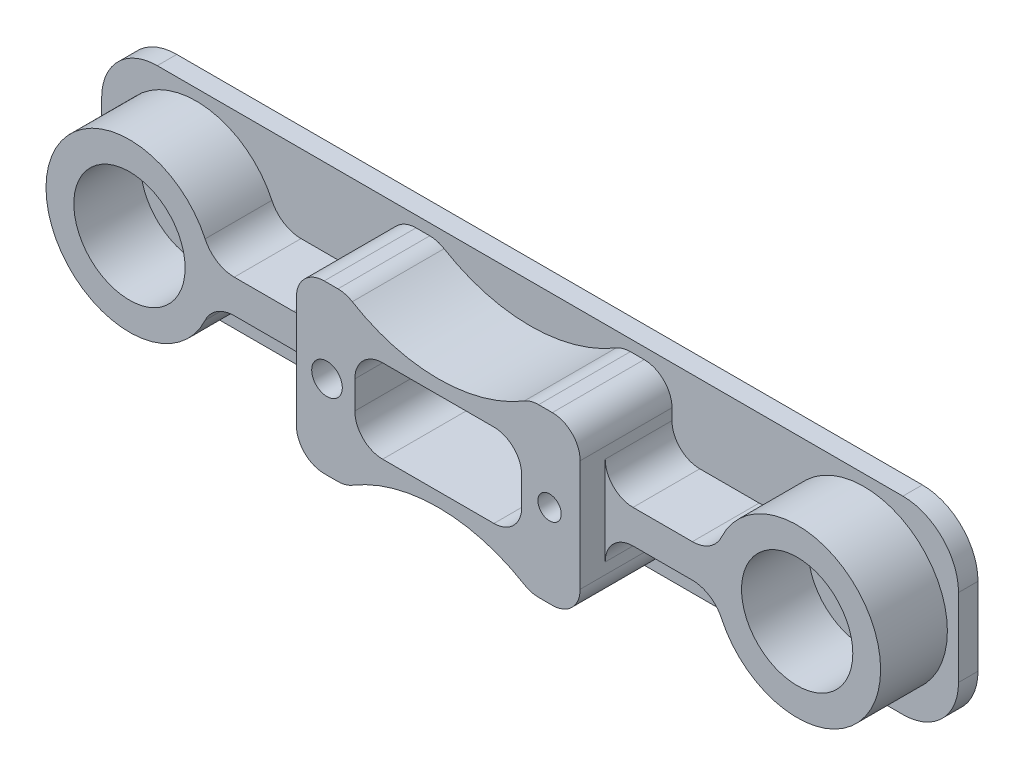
from build123d import *

# Parameters (mm, degrees)
AUFSATZ_LINEAR_AUSTRAGEN1_DEPTH                      = 3.5
AUFSATZ_LINEAR_AUSTRAGEN2_DEPTH                      = 12
SKIZZE3_R                                            = 10
SCHNITT_LINEAR_AUSTRAGEN1_DEPTH                      = 12
AUFSATZ_LINEAR_AUSTRAGEN3_DEPTH                      = 16.5
SCHNITT_LINEAR_AUSTRAGEN2_DEPTH                      = 16.5
M5_GEWINDEBOHRUNG1_D                                 = 4.2
M5_GEWINDEBOHRUNG1_DEPTH                             = 17
M5_GEWINDEBOHRUNG1_TIP                               = 1.2618073
KERNLOCH_F_R_M61_D                                   = 10.4
KERNLOCH_F_R_M61_DEPTH                               = 0.5
KERNLOCH_F_R_M61_TIP                                 = 5.2
FORMSENKUNG_F_R_M5_SENKSCHRAUBE_MIT_INNE_D           = 5.5
FORMSENKUNG_F_R_M5_SENKSCHRAUBE_MIT_INNE_CSINK_D     = 10.4
FORMSENKUNG_F_R_M5_SENKSCHRAUBE_MIT_INNE_CSINK_ANGLE = 90
SCHNITT_LINEAR_AUSTRAGEN3_DEPTH                      = 16.5
VERRUNDUNG1_R                                        = 5
VERRUNDUNG2_R                                        = 5


with BuildPart() as part:
    # Skizze1 → Aufsatz-Linear austragen1 (new body)
    with BuildSketch(Plane.XY):
        with BuildLine():
            Line((-67, 17), (67, 17))
            ThreePointArc((67, 17), (74.071067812, 14.071067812), (77, 7))
            Line((77, 7), (77, -7))
            ThreePointArc((77, -7), (74.071067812, -14.071067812), (67, -17))
            Line((67, -17), (-67, -17))
            ThreePointArc((-67, -17), (-74.071067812, -14.071067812), (-77, -7))
            Line((-77, -7), (-77, 7))
            ThreePointArc((-77, 7), (-74.071067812, 14.071067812), (-67, 17))
        make_face()
    extrude(amount=AUFSATZ_LINEAR_AUSTRAGEN1_DEPTH)

    # Skizze2 → Aufsatz-Linear austragen2 (add)
    with BuildSketch(Plane.XY.offset(3.5)):
        with BuildLine():
            Line((41.165812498, 3), (-41.165812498, 3))
            ThreePointArc((-41.165812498, 3), (-44.271791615, 3.90539303), (-46.404761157, 6.337939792))
            ThreePointArc((-46.404761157, 6.337939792), (-75, 0), (-46.404761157, -6.337939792))
            ThreePointArc((-46.404761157, -6.337939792), (-44.271791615, -3.90539303), (-41.165812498, -3))
            Line((-41.165812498, -3), (41.165812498, -3))
            ThreePointArc((41.165812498, -3), (44.271791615, -3.90539303), (46.404761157, -6.337939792))
            ThreePointArc((46.404761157, -6.337939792), (75, 0), (46.404761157, 6.337939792))
            ThreePointArc((46.404761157, 6.337939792), (44.271791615, 3.90539303), (41.165812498, 3))
        make_face()
    extrude(amount=AUFSATZ_LINEAR_AUSTRAGEN2_DEPTH)

    # Skizze3 → Schnitt-Linear austragen1 (cut)
    with BuildSketch(Plane.XY.offset(15.5)):
        with Locations((-60, 0)):
            Circle(SKIZZE3_R)
        with Locations((60, 0)):
            Circle(SKIZZE3_R)
    extrude(amount=-SCHNITT_LINEAR_AUSTRAGEN1_DEPTH, mode=Mode.SUBTRACT)

    # Skizze4 → Aufsatz-Linear austragen3 (add)
    with BuildSketch(Plane.XY.offset(3.5)):
        with BuildLine():
            Line((-20.5, 15), (20.5, 15))
            ThreePointArc((20.5, 15), (24.035533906, 13.535533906), (25.5, 10))
            Line((25.5, 10), (25.5, -10))
            ThreePointArc((25.5, -10), (24.035533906, -13.535533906), (20.5, -15))
            Line((20.5, -15), (-20.5, -15))
            ThreePointArc((-20.5, -15), (-24.035533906, -13.535533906), (-25.5, -10))
            Line((-25.5, -10), (-25.5, 10))
            ThreePointArc((-25.5, 10), (-24.035533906, 13.535533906), (-20.5, 15))
        make_face()
    extrude(amount=AUFSATZ_LINEAR_AUSTRAGEN3_DEPTH)

    # Skizze5 → Schnitt-Linear austragen2 (cut)
    with BuildSketch(Plane.XY.offset(20)):
        with BuildLine():
            Line((-10, 7.5), (10, 7.5))
            ThreePointArc((10, 7.5), (13.535533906, 6.035533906), (15, 2.5))
            Line((15, 2.5), (15, -2.5))
            ThreePointArc((15, -2.5), (13.535533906, -6.035533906), (10, -7.5))
            Line((10, -7.5), (-10, -7.5))
            ThreePointArc((-10, -7.5), (-13.535533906, -6.035533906), (-15, -2.5))
            Line((-15, -2.5), (-15, 2.5))
            ThreePointArc((-15, 2.5), (-13.535533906, 6.035533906), (-10, 7.5))
        make_face()
    extrude(amount=-SCHNITT_LINEAR_AUSTRAGEN2_DEPTH, mode=Mode.SUBTRACT)

    # M5 Gewindebohrung1
    with Locations(Plane.XY.offset(20)):
        with Locations((20, 0)):
            Hole(M5_GEWINDEBOHRUNG1_D / 2, depth=M5_GEWINDEBOHRUNG1_DEPTH)
            with Locations((0, 0, -(M5_GEWINDEBOHRUNG1_DEPTH + M5_GEWINDEBOHRUNG1_TIP / 2))):  # 118° drill point
                Cone(0, M5_GEWINDEBOHRUNG1_D / 2, M5_GEWINDEBOHRUNG1_TIP, mode=Mode.SUBTRACT)

    # Kernloch f_r M61
    with Locations(Plane(origin=(0, 0, 0), x_dir=(-1, 0, 0), z_dir=(0, 0, -1))):
        with Locations((20, 0)):
            Hole(KERNLOCH_F_R_M61_D / 2, depth=KERNLOCH_F_R_M61_DEPTH)
            with Locations((0, 0, -(KERNLOCH_F_R_M61_DEPTH + KERNLOCH_F_R_M61_TIP / 2))):  # 90° drill point
                Cone(0, KERNLOCH_F_R_M61_D / 2, KERNLOCH_F_R_M61_TIP, mode=Mode.SUBTRACT)

    # Formsenkung f_r M5 Senkschraube mit Inne (through all)
    with Locations(Plane(origin=(-20, 0, 0), x_dir=(-1, 0, 0), z_dir=(0, 0, -1))):
        with Locations((0, 0)):
            CounterSinkHole(FORMSENKUNG_F_R_M5_SENKSCHRAUBE_MIT_INNE_D / 2, FORMSENKUNG_F_R_M5_SENKSCHRAUBE_MIT_INNE_CSINK_D / 2, counter_sink_angle=FORMSENKUNG_F_R_M5_SENKSCHRAUBE_MIT_INNE_CSINK_ANGLE)

    # Skizze11 → Schnitt-Linear austragen3 (cut)
    with BuildSketch(Plane.XY.offset(20)):
        with BuildLine():
            Line((16.583123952, 15), (-16.583123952, 15))
            ThreePointArc((-16.583123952, 15), (0, 10), (16.583123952, 15))
        make_face()
        with BuildLine():
            ThreePointArc((16.583123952, -15), (0, -10), (-16.583123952, -15))
            Line((-16.583123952, -15), (16.583123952, -15))
        make_face()
    extrude(amount=-SCHNITT_LINEAR_AUSTRAGEN3_DEPTH, mode=Mode.SUBTRACT)

    # Verrundung1
    verrundung1_edges = [part.edges().sort_by_distance(p)[0] for p in [
        (-16.583123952, 15, 11.75),
        (16.583123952, 15, 11.75),
        (-16.583123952, -15, 11.75),
        (16.583123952, -15, 11.75),
    ]]
    fillet(verrundung1_edges, radius=VERRUNDUNG1_R)

    # Verrundung2
    verrundung2_edges = [part.edges().sort_by_distance(p)[0] for p in [
        (25.5, -3, 9.5),
        (25.5, 3, 9.5),
        (-25.5, -3, 9.5),
        (-25.5, 3, 9.5),
    ]]
    fillet(verrundung2_edges, radius=VERRUNDUNG2_R)


solid = part.part
